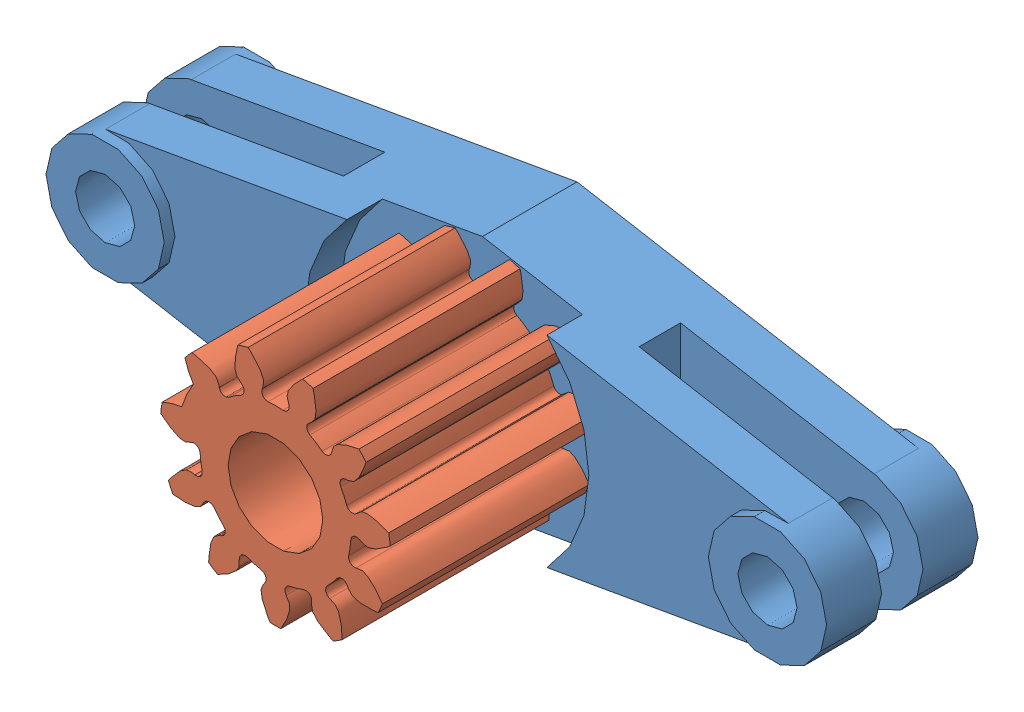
SolidWorks assembly Support_massellotes.SLDASM, configuration Défaut (file format 11000). Lengths in mm.
Overall size (66 20 26.4).
2 component instances, 2 part files, 1 mates.
Components (placement in the parent):
- Support_masselottes_bras-1: Support_masselottes_bras.SLDPRT [Défaut] at (-267.5727 15.86 0) size (66 20 12.8)
- Support_masselottes_pignon-1: Support_masselottes_pignon.SLDPRT [Défaut] at (-267.5727 15.86 2.5) size (19.41 19.22 17.5)
Mates (geometry in assembly coordinates):
- Coaxial1: concentric: cylinder of Support_masselottes_bras-1 through (-267.5727 15.86 -6.4) axis (0 0 1) radius 4; cylinder of Support_masselottes_pignon-1 through (-267.5727 15.86 20) axis (0 0 -1) radius 6.375
